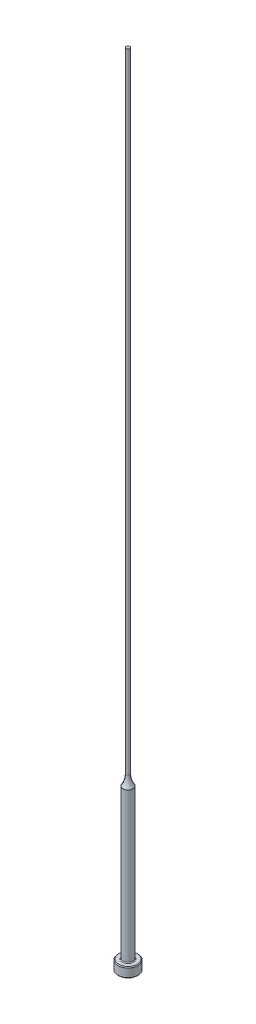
from build123d import *

# Parameters (mm, degrees)
CHAMFER1_SIZE = 0.254
FILLET1_R     = 0.254


with BuildPart() as part:
    # Sketch1 → Revolve1 (revolve)
    with BuildSketch(Plane.XY, mode=Mode.PRIVATE) as revolve1_sk:
        with BuildLine():
            Line((0, 0), (-3.175, 0))
            Line((-3.175, 0), (-3.175, 3.175))
            Line((-3.175, 3.175), (-1.5875, 3.175))
            Line((-1.5875, 3.175), (-1.5875, 50.8))
            ThreePointArc((-1.5875, 50.8), (-0.847698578, 52.434042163), (-0.59436, 54.209772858))
            Line((-0.59436, 54.209772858), (-0.59436, 254))
            Line((-0.59436, 254), (0, 254))
            Line((0, 254), (0, 0))
        make_face()
    revolve(revolve1_sk.sketch.rotate(Axis((0, 259.958771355, 0), (0, -1, 0)), 270), axis=Axis((0, 259.958771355, 0), (0, -1, 0)))

    # Chamfer1
    chamfer1_edges = [part.edges().sort_by_distance(p)[0] for p in [
        (0, 0, -3.175),
        (0, 3.175, -3.175),
    ]]
    chamfer(chamfer1_edges, length=CHAMFER1_SIZE)

    # Fillet1
    fillet1_edges = [part.edges().sort_by_distance(p)[0] for p in [
        (0, 3.175, -1.5875),
    ]]
    fillet(fillet1_edges, radius=FILLET1_R)


solid = part.part
